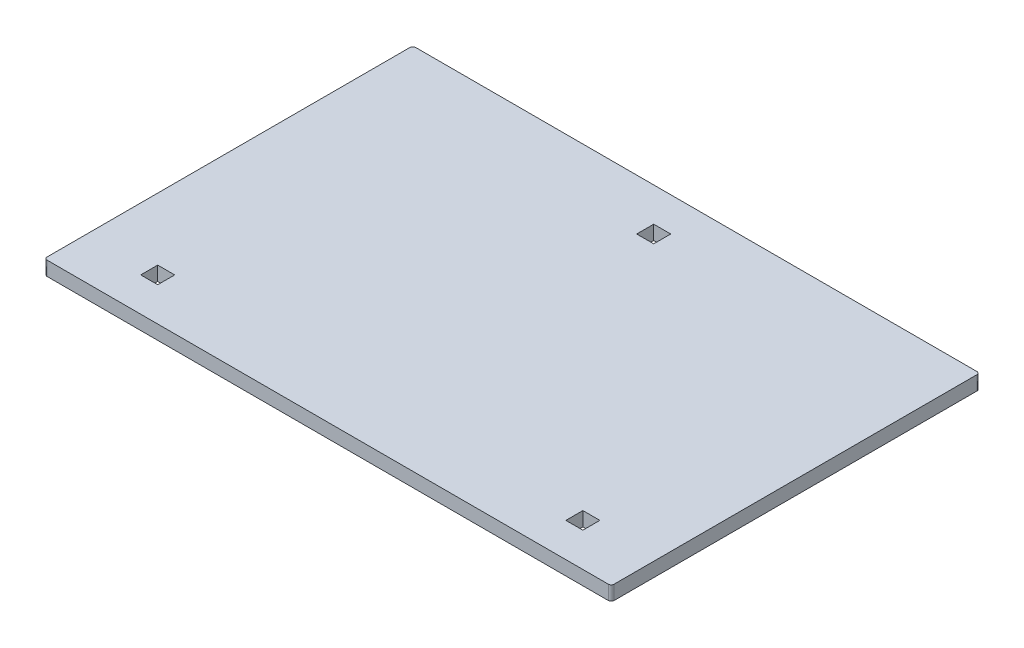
ISO-10303-21;
HEADER;
FILE_DESCRIPTION(('STEP AP214'),'2;1');
FILE_NAME('part.step','',(''),(''),'','','');
FILE_SCHEMA(('AUTOMOTIVE_DESIGN { 1 0 10303 214 1 1 1 1 }'));
ENDSEC;
DATA;
#1=APPLICATION_CONTEXT('core data for automotive mechanical design processes');
#2=APPLICATION_PROTOCOL_DEFINITION('international standard','automotive_design',2000,#1);
#3=PRODUCT_CONTEXT('',#1,'mechanical');
#4=PRODUCT('Part','Part','',(#3));
#5=PRODUCT_RELATED_PRODUCT_CATEGORY('part','',(#4));
#6=PRODUCT_DEFINITION_FORMATION('','',#4);
#7=PRODUCT_DEFINITION_CONTEXT('part definition',#1,'design');
#8=PRODUCT_DEFINITION('design','',#6,#7);
#9=PRODUCT_DEFINITION_SHAPE('','',#8);
#10=(LENGTH_UNIT() NAMED_UNIT(*) SI_UNIT(.MILLI.,.METRE.));
#11=(NAMED_UNIT(*) PLANE_ANGLE_UNIT() SI_UNIT($,.RADIAN.));
#12=(NAMED_UNIT(*) SI_UNIT($,.STERADIAN.) SOLID_ANGLE_UNIT());
#13=UNCERTAINTY_MEASURE_WITH_UNIT(LENGTH_MEASURE(1.E-05),#10,'distance_accuracy_value','');
#14=(GEOMETRIC_REPRESENTATION_CONTEXT(3) GLOBAL_UNCERTAINTY_ASSIGNED_CONTEXT((#13)) GLOBAL_UNIT_ASSIGNED_CONTEXT((#10,
#11,#12)) REPRESENTATION_CONTEXT('',''));
#15=CARTESIAN_POINT('',(0.,0.,0.));
#16=DIRECTION('',(0.,0.,1.));
#17=DIRECTION('',(1.,0.,0.));
#18=AXIS2_PLACEMENT_3D('',#15,#16,#17);
#19=CARTESIAN_POINT('',(0.,5.,0.));
#20=DIRECTION('',(0.,1.,0.));
#21=DIRECTION('',(0.,0.,1.));
#22=AXIS2_PLACEMENT_3D('',#19,#20,#21);
#23=PLANE('',#22);
#24=DIRECTION('',(1.,0.,0.));
#25=VECTOR('',#24,1.);
#26=CARTESIAN_POINT('',(22.,5.,118.));
#27=LINE('',#26,#25);
#28=CARTESIAN_POINT('',(22.,5.,118.));
#29=VERTEX_POINT('',#28);
#30=CARTESIAN_POINT('',(28.,5.,118.));
#31=VERTEX_POINT('',#30);
#32=EDGE_CURVE('E214',#29,#31,#27,.T.);
#33=ORIENTED_EDGE('',*,*,#32,.F.);
#34=DIRECTION('',(0.,0.,1.));
#35=VECTOR('',#34,1.);
#36=CARTESIAN_POINT('',(22.,5.,112.));
#37=LINE('',#36,#35);
#38=CARTESIAN_POINT('',(22.,5.,112.));
#39=VERTEX_POINT('',#38);
#40=EDGE_CURVE('E212',#39,#29,#37,.T.);
#41=ORIENTED_EDGE('',*,*,#40,.F.);
#42=DIRECTION('',(-1.,0.,0.));
#43=VECTOR('',#42,1.);
#44=CARTESIAN_POINT('',(22.,5.,112.));
#45=LINE('',#44,#43);
#46=CARTESIAN_POINT('',(28.,5.,112.));
#47=VERTEX_POINT('',#46);
#48=EDGE_CURVE('E220',#47,#39,#45,.T.);
#49=ORIENTED_EDGE('',*,*,#48,.F.);
#50=DIRECTION('',(0.,0.,-1.));
#51=VECTOR('',#50,1.);
#52=CARTESIAN_POINT('',(28.,5.,112.));
#53=LINE('',#52,#51);
#54=EDGE_CURVE('E217',#31,#47,#53,.T.);
#55=ORIENTED_EDGE('',*,*,#54,.F.);
#56=EDGE_LOOP('',(#33,#41,#49,#55));
#57=FACE_BOUND('',#56,.T.);
#58=DIRECTION('',(-1.,0.,0.));
#59=VECTOR('',#58,1.);
#60=CARTESIAN_POINT('',(0.,5.,0.));
#61=LINE('',#60,#59);
#62=CARTESIAN_POINT('',(199.,5.,0.));
#63=VERTEX_POINT('',#62);
#64=CARTESIAN_POINT('',(1.,5.,0.));
#65=VERTEX_POINT('',#64);
#66=EDGE_CURVE('E281',#63,#65,#61,.T.);
#67=ORIENTED_EDGE('',*,*,#66,.T.);
#68=CARTESIAN_POINT('',(1.,5.,1.));
#69=DIRECTION('',(0.,1.,0.));
#70=DIRECTION('',(0.,0.,1.));
#71=AXIS2_PLACEMENT_3D('',#68,#69,#70);
#72=CIRCLE('',#71,1.);
#73=CARTESIAN_POINT('',(0.,5.,1.));
#74=VERTEX_POINT('',#73);
#75=EDGE_CURVE('E316',#65,#74,#72,.T.);
#76=ORIENTED_EDGE('',*,*,#75,.T.);
#77=DIRECTION('',(0.,0.,1.));
#78=VECTOR('',#77,1.);
#79=CARTESIAN_POINT('',(0.,5.,0.));
#80=LINE('',#79,#78);
#81=CARTESIAN_POINT('',(0.,5.,129.));
#82=VERTEX_POINT('',#81);
#83=EDGE_CURVE('E273',#74,#82,#80,.T.);
#84=ORIENTED_EDGE('',*,*,#83,.T.);
#85=CARTESIAN_POINT('',(1.00000000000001,5.,129.));
#86=DIRECTION('',(0.,1.,0.));
#87=DIRECTION('',(0.,0.,1.));
#88=AXIS2_PLACEMENT_3D('',#85,#86,#87);
#89=CIRCLE('',#88,1.);
#90=CARTESIAN_POINT('',(1.00000000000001,5.,130.));
#91=VERTEX_POINT('',#90);
#92=EDGE_CURVE('E314',#82,#91,#89,.T.);
#93=ORIENTED_EDGE('',*,*,#92,.T.);
#94=DIRECTION('',(1.,0.,0.));
#95=VECTOR('',#94,1.);
#96=CARTESIAN_POINT('',(0.,5.,130.));
#97=LINE('',#96,#95);
#98=CARTESIAN_POINT('',(199.,5.,130.));
#99=VERTEX_POINT('',#98);
#100=EDGE_CURVE('E276',#91,#99,#97,.T.);
#101=ORIENTED_EDGE('',*,*,#100,.T.);
#102=CARTESIAN_POINT('',(199.,5.,129.));
#103=DIRECTION('',(0.,1.,0.));
#104=DIRECTION('',(0.,0.,1.));
#105=AXIS2_PLACEMENT_3D('',#102,#103,#104);
#106=CIRCLE('',#105,1.);
#107=CARTESIAN_POINT('',(200.,5.,129.));
#108=VERTEX_POINT('',#107);
#109=EDGE_CURVE('E53',#99,#108,#106,.T.);
#110=ORIENTED_EDGE('',*,*,#109,.T.);
#111=DIRECTION('',(0.,0.,-1.));
#112=VECTOR('',#111,1.);
#113=CARTESIAN_POINT('',(200.,5.,0.));
#114=LINE('',#113,#112);
#115=CARTESIAN_POINT('',(200.,5.,1.));
#116=VERTEX_POINT('',#115);
#117=EDGE_CURVE('E279',#108,#116,#114,.T.);
#118=ORIENTED_EDGE('',*,*,#117,.T.);
#119=CARTESIAN_POINT('',(199.,5.,1.));
#120=DIRECTION('',(0.,1.,0.));
#121=DIRECTION('',(0.,0.,1.));
#122=AXIS2_PLACEMENT_3D('',#119,#120,#121);
#123=CIRCLE('',#122,1.);
#124=EDGE_CURVE('E312',#116,#63,#123,.T.);
#125=ORIENTED_EDGE('',*,*,#124,.T.);
#126=EDGE_LOOP('',(#67,#76,#84,#93,#101,#110,#118,#125));
#127=FACE_BOUND('',#126,.T.);
#128=DIRECTION('',(1.,0.,0.));
#129=VECTOR('',#128,1.);
#130=CARTESIAN_POINT('',(100.,5.,18.));
#131=LINE('',#130,#129);
#132=CARTESIAN_POINT('',(97.,5.,18.));
#133=VERTEX_POINT('',#132);
#134=CARTESIAN_POINT('',(103.,5.,18.));
#135=VERTEX_POINT('',#134);
#136=EDGE_CURVE('E248',#133,#135,#131,.T.);
#137=ORIENTED_EDGE('',*,*,#136,.F.);
#138=DIRECTION('',(0.,0.,1.));
#139=VECTOR('',#138,1.);
#140=CARTESIAN_POINT('',(97.,5.,12.));
#141=LINE('',#140,#139);
#142=CARTESIAN_POINT('',(97.,5.,12.));
#143=VERTEX_POINT('',#142);
#144=EDGE_CURVE('E245',#143,#133,#141,.T.);
#145=ORIENTED_EDGE('',*,*,#144,.F.);
#146=DIRECTION('',(-1.,0.,0.));
#147=VECTOR('',#146,1.);
#148=CARTESIAN_POINT('',(100.,5.,12.));
#149=LINE('',#148,#147);
#150=CARTESIAN_POINT('',(103.,5.,12.));
#151=VERTEX_POINT('',#150);
#152=EDGE_CURVE('E243',#151,#143,#149,.T.);
#153=ORIENTED_EDGE('',*,*,#152,.F.);
#154=DIRECTION('',(0.,0.,-1.));
#155=VECTOR('',#154,1.);
#156=CARTESIAN_POINT('',(103.,5.,12.));
#157=LINE('',#156,#155);
#158=EDGE_CURVE('E250',#135,#151,#157,.T.);
#159=ORIENTED_EDGE('',*,*,#158,.F.);
#160=EDGE_LOOP('',(#137,#145,#153,#159));
#161=FACE_BOUND('',#160,.T.);
#162=DIRECTION('',(1.,0.,0.));
#163=VECTOR('',#162,1.);
#164=CARTESIAN_POINT('',(172.,5.,118.));
#165=LINE('',#164,#163);
#166=CARTESIAN_POINT('',(172.,5.,118.));
#167=VERTEX_POINT('',#166);
#168=CARTESIAN_POINT('',(178.,5.,118.));
#169=VERTEX_POINT('',#168);
#170=EDGE_CURVE('E181',#167,#169,#165,.T.);
#171=ORIENTED_EDGE('',*,*,#170,.F.);
#172=DIRECTION('',(0.,0.,1.));
#173=VECTOR('',#172,1.);
#174=CARTESIAN_POINT('',(172.,5.,112.));
#175=LINE('',#174,#173);
#176=CARTESIAN_POINT('',(172.,5.,112.));
#177=VERTEX_POINT('',#176);
#178=EDGE_CURVE('E171',#177,#167,#175,.T.);
#179=ORIENTED_EDGE('',*,*,#178,.F.);
#180=DIRECTION('',(-1.,0.,0.));
#181=VECTOR('',#180,1.);
#182=CARTESIAN_POINT('',(172.,5.,112.));
#183=LINE('',#182,#181);
#184=CARTESIAN_POINT('',(178.,5.,112.));
#185=VERTEX_POINT('',#184);
#186=EDGE_CURVE('E196',#185,#177,#183,.T.);
#187=ORIENTED_EDGE('',*,*,#186,.F.);
#188=DIRECTION('',(0.,0.,-1.));
#189=VECTOR('',#188,1.);
#190=CARTESIAN_POINT('',(178.,5.,112.));
#191=LINE('',#190,#189);
#192=EDGE_CURVE('E194',#169,#185,#191,.T.);
#193=ORIENTED_EDGE('',*,*,#192,.F.);
#194=EDGE_LOOP('',(#171,#179,#187,#193));
#195=FACE_BOUND('',#194,.T.);
#196=ADVANCED_FACE('F33',(#57,#127,#161,#195),#23,.T.);
#197=CARTESIAN_POINT('',(0.,0.,0.));
#198=DIRECTION('',(0.,1.,0.));
#199=DIRECTION('',(0.,0.,1.));
#200=AXIS2_PLACEMENT_3D('',#197,#198,#199);
#201=PLANE('',#200);
#202=DIRECTION('',(0.,0.,1.));
#203=VECTOR('',#202,1.);
#204=CARTESIAN_POINT('',(22.,0.,112.));
#205=LINE('',#204,#203);
#206=CARTESIAN_POINT('',(22.,0.,112.));
#207=VERTEX_POINT('',#206);
#208=CARTESIAN_POINT('',(22.,0.,118.));
#209=VERTEX_POINT('',#208);
#210=EDGE_CURVE('E189',#207,#209,#205,.T.);
#211=ORIENTED_EDGE('',*,*,#210,.T.);
#212=DIRECTION('',(1.,0.,0.));
#213=VECTOR('',#212,1.);
#214=CARTESIAN_POINT('',(22.,0.,118.));
#215=LINE('',#214,#213);
#216=CARTESIAN_POINT('',(28.,0.,118.));
#217=VERTEX_POINT('',#216);
#218=EDGE_CURVE('E225',#209,#217,#215,.T.);
#219=ORIENTED_EDGE('',*,*,#218,.T.);
#220=DIRECTION('',(0.,0.,-1.));
#221=VECTOR('',#220,1.);
#222=CARTESIAN_POINT('',(28.,0.,112.));
#223=LINE('',#222,#221);
#224=CARTESIAN_POINT('',(28.,0.,112.));
#225=VERTEX_POINT('',#224);
#226=EDGE_CURVE('E228',#217,#225,#223,.T.);
#227=ORIENTED_EDGE('',*,*,#226,.T.);
#228=DIRECTION('',(-1.,0.,0.));
#229=VECTOR('',#228,1.);
#230=CARTESIAN_POINT('',(22.,0.,112.));
#231=LINE('',#230,#229);
#232=EDGE_CURVE('E215',#225,#207,#231,.T.);
#233=ORIENTED_EDGE('',*,*,#232,.T.);
#234=EDGE_LOOP('',(#211,#219,#227,#233));
#235=FACE_BOUND('',#234,.T.);
#236=DIRECTION('',(0.,0.,1.));
#237=VECTOR('',#236,1.);
#238=CARTESIAN_POINT('',(0.,0.,0.));
#239=LINE('',#238,#237);
#240=CARTESIAN_POINT('',(0.,0.,1.));
#241=VERTEX_POINT('',#240);
#242=CARTESIAN_POINT('',(0.,0.,129.));
#243=VERTEX_POINT('',#242);
#244=EDGE_CURVE('E272',#241,#243,#239,.T.);
#245=ORIENTED_EDGE('',*,*,#244,.F.);
#246=CARTESIAN_POINT('',(1.,0.,1.));
#247=DIRECTION('',(0.,1.,0.));
#248=DIRECTION('',(0.,0.,1.));
#249=AXIS2_PLACEMENT_3D('',#246,#247,#248);
#250=CIRCLE('',#249,1.);
#251=CARTESIAN_POINT('',(1.,0.,0.));
#252=VERTEX_POINT('',#251);
#253=EDGE_CURVE('E304',#241,#252,#250,.F.);
#254=ORIENTED_EDGE('',*,*,#253,.T.);
#255=DIRECTION('',(-1.,0.,0.));
#256=VECTOR('',#255,1.);
#257=CARTESIAN_POINT('',(0.,0.,0.));
#258=LINE('',#257,#256);
#259=CARTESIAN_POINT('',(199.,0.,0.));
#260=VERTEX_POINT('',#259);
#261=EDGE_CURVE('E277',#260,#252,#258,.T.);
#262=ORIENTED_EDGE('',*,*,#261,.F.);
#263=CARTESIAN_POINT('',(199.,0.,1.));
#264=DIRECTION('',(0.,1.,0.));
#265=DIRECTION('',(0.,0.,1.));
#266=AXIS2_PLACEMENT_3D('',#263,#264,#265);
#267=CIRCLE('',#266,1.);
#268=CARTESIAN_POINT('',(200.,0.,1.));
#269=VERTEX_POINT('',#268);
#270=EDGE_CURVE('E300',#260,#269,#267,.F.);
#271=ORIENTED_EDGE('',*,*,#270,.T.);
#272=DIRECTION('',(0.,0.,-1.));
#273=VECTOR('',#272,1.);
#274=CARTESIAN_POINT('',(200.,0.,0.));
#275=LINE('',#274,#273);
#276=CARTESIAN_POINT('',(200.,0.,129.));
#277=VERTEX_POINT('',#276);
#278=EDGE_CURVE('E290',#277,#269,#275,.T.);
#279=ORIENTED_EDGE('',*,*,#278,.F.);
#280=CARTESIAN_POINT('',(199.,0.,129.));
#281=DIRECTION('',(0.,1.,0.));
#282=DIRECTION('',(0.,0.,1.));
#283=AXIS2_PLACEMENT_3D('',#280,#281,#282);
#284=CIRCLE('',#283,1.);
#285=CARTESIAN_POINT('',(199.,0.,130.));
#286=VERTEX_POINT('',#285);
#287=EDGE_CURVE('E298',#277,#286,#284,.F.);
#288=ORIENTED_EDGE('',*,*,#287,.T.);
#289=DIRECTION('',(1.,0.,0.));
#290=VECTOR('',#289,1.);
#291=CARTESIAN_POINT('',(102.55,0.,130.));
#292=LINE('',#291,#290);
#293=CARTESIAN_POINT('',(1.00000000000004,0.,130.));
#294=VERTEX_POINT('',#293);
#295=EDGE_CURVE('E287',#294,#286,#292,.T.);
#296=ORIENTED_EDGE('',*,*,#295,.F.);
#297=CARTESIAN_POINT('',(1.00000000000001,0.,129.));
#298=DIRECTION('',(0.,1.,0.));
#299=DIRECTION('',(0.,0.,1.));
#300=AXIS2_PLACEMENT_3D('',#297,#298,#299);
#301=CIRCLE('',#300,1.);
#302=EDGE_CURVE('E302',#294,#243,#301,.F.);
#303=ORIENTED_EDGE('',*,*,#302,.T.);
#304=EDGE_LOOP('',(#245,#254,#262,#271,#279,#288,#296,#303));
#305=FACE_BOUND('',#304,.T.);
#306=DIRECTION('',(0.,0.,1.));
#307=VECTOR('',#306,1.);
#308=CARTESIAN_POINT('',(97.,0.,12.));
#309=LINE('',#308,#307);
#310=CARTESIAN_POINT('',(97.,0.,12.));
#311=VERTEX_POINT('',#310);
#312=CARTESIAN_POINT('',(97.,0.,18.));
#313=VERTEX_POINT('',#312);
#314=EDGE_CURVE('E242',#311,#313,#309,.T.);
#315=ORIENTED_EDGE('',*,*,#314,.T.);
#316=DIRECTION('',(1.,0.,0.));
#317=VECTOR('',#316,1.);
#318=CARTESIAN_POINT('',(100.,0.,18.));
#319=LINE('',#318,#317);
#320=CARTESIAN_POINT('',(103.,0.,18.));
#321=VERTEX_POINT('',#320);
#322=EDGE_CURVE('E256',#313,#321,#319,.T.);
#323=ORIENTED_EDGE('',*,*,#322,.T.);
#324=DIRECTION('',(0.,0.,-1.));
#325=VECTOR('',#324,1.);
#326=CARTESIAN_POINT('',(103.,0.,12.));
#327=LINE('',#326,#325);
#328=CARTESIAN_POINT('',(103.,0.,12.));
#329=VERTEX_POINT('',#328);
#330=EDGE_CURVE('E259',#321,#329,#327,.T.);
#331=ORIENTED_EDGE('',*,*,#330,.T.);
#332=DIRECTION('',(-1.,0.,0.));
#333=VECTOR('',#332,1.);
#334=CARTESIAN_POINT('',(100.,0.,12.));
#335=LINE('',#334,#333);
#336=EDGE_CURVE('E246',#329,#311,#335,.T.);
#337=ORIENTED_EDGE('',*,*,#336,.T.);
#338=EDGE_LOOP('',(#315,#323,#331,#337));
#339=FACE_BOUND('',#338,.T.);
#340=DIRECTION('',(0.,0.,1.));
#341=VECTOR('',#340,1.);
#342=CARTESIAN_POINT('',(172.,0.,112.));
#343=LINE('',#342,#341);
#344=CARTESIAN_POINT('',(172.,0.,112.));
#345=VERTEX_POINT('',#344);
#346=CARTESIAN_POINT('',(172.,0.,118.));
#347=VERTEX_POINT('',#346);
#348=EDGE_CURVE('E200',#345,#347,#343,.T.);
#349=ORIENTED_EDGE('',*,*,#348,.T.);
#350=DIRECTION('',(1.,0.,0.));
#351=VECTOR('',#350,1.);
#352=CARTESIAN_POINT('',(172.,0.,118.));
#353=LINE('',#352,#351);
#354=CARTESIAN_POINT('',(178.,0.,118.));
#355=VERTEX_POINT('',#354);
#356=EDGE_CURVE('E188',#347,#355,#353,.T.);
#357=ORIENTED_EDGE('',*,*,#356,.T.);
#358=DIRECTION('',(0.,0.,-1.));
#359=VECTOR('',#358,1.);
#360=CARTESIAN_POINT('',(178.,0.,112.));
#361=LINE('',#360,#359);
#362=CARTESIAN_POINT('',(178.,0.,112.));
#363=VERTEX_POINT('',#362);
#364=EDGE_CURVE('E203',#355,#363,#361,.T.);
#365=ORIENTED_EDGE('',*,*,#364,.T.);
#366=DIRECTION('',(-1.,0.,0.));
#367=VECTOR('',#366,1.);
#368=CARTESIAN_POINT('',(172.,0.,112.));
#369=LINE('',#368,#367);
#370=EDGE_CURVE('E182',#363,#345,#369,.T.);
#371=ORIENTED_EDGE('',*,*,#370,.T.);
#372=EDGE_LOOP('',(#349,#357,#365,#371));
#373=FACE_BOUND('',#372,.T.);
#374=ADVANCED_FACE('F329',(#235,#305,#339,#373),#201,.F.);
#375=CARTESIAN_POINT('',(0.,5.,0.));
#376=DIRECTION('',(1.,0.,0.));
#377=DIRECTION('',(0.,0.,-1.));
#378=AXIS2_PLACEMENT_3D('',#375,#376,#377);
#379=PLANE('',#378);
#380=ORIENTED_EDGE('',*,*,#83,.F.);
#381=DIRECTION('',(0.,-1.,0.));
#382=VECTOR('',#381,1.);
#383=CARTESIAN_POINT('',(0.,5.,1.));
#384=LINE('',#383,#382);
#385=EDGE_CURVE('E295',#74,#241,#384,.T.);
#386=ORIENTED_EDGE('',*,*,#385,.T.);
#387=ORIENTED_EDGE('',*,*,#244,.T.);
#388=DIRECTION('',(0.,-1.,0.));
#389=VECTOR('',#388,1.);
#390=CARTESIAN_POINT('',(0.,5.,129.));
#391=LINE('',#390,#389);
#392=EDGE_CURVE('E284',#243,#82,#391,.F.);
#393=ORIENTED_EDGE('',*,*,#392,.T.);
#394=EDGE_LOOP('',(#380,#386,#387,#393));
#395=FACE_BOUND('',#394,.T.);
#396=ADVANCED_FACE('F348',(#395),#379,.F.);
#397=CARTESIAN_POINT('',(102.55,5.,130.));
#398=DIRECTION('',(0.,0.,-1.));
#399=DIRECTION('',(-1.,0.,0.));
#400=AXIS2_PLACEMENT_3D('',#397,#398,#399);
#401=PLANE('',#400);
#402=ORIENTED_EDGE('',*,*,#100,.F.);
#403=DIRECTION('',(0.,-1.,0.));
#404=VECTOR('',#403,1.);
#405=CARTESIAN_POINT('',(1.00000000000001,5.,130.));
#406=LINE('',#405,#404);
#407=EDGE_CURVE('E320',#91,#294,#406,.T.);
#408=ORIENTED_EDGE('',*,*,#407,.T.);
#409=ORIENTED_EDGE('',*,*,#295,.T.);
#410=DIRECTION('',(0.,-1.,0.));
#411=VECTOR('',#410,1.);
#412=CARTESIAN_POINT('',(199.,5.,130.));
#413=LINE('',#412,#411);
#414=EDGE_CURVE('E318',#286,#99,#413,.F.);
#415=ORIENTED_EDGE('',*,*,#414,.T.);
#416=EDGE_LOOP('',(#402,#408,#409,#415));
#417=FACE_BOUND('',#416,.T.);
#418=ADVANCED_FACE('F356',(#417),#401,.F.);
#419=CARTESIAN_POINT('',(200.,5.,0.));
#420=DIRECTION('',(-1.,0.,0.));
#421=DIRECTION('',(0.,0.,1.));
#422=AXIS2_PLACEMENT_3D('',#419,#420,#421);
#423=PLANE('',#422);
#424=ORIENTED_EDGE('',*,*,#278,.T.);
#425=DIRECTION('',(0.,-1.,0.));
#426=VECTOR('',#425,1.);
#427=CARTESIAN_POINT('',(200.,5.,1.));
#428=LINE('',#427,#426);
#429=EDGE_CURVE('E11',#269,#116,#428,.F.);
#430=ORIENTED_EDGE('',*,*,#429,.T.);
#431=ORIENTED_EDGE('',*,*,#117,.F.);
#432=DIRECTION('',(0.,-1.,0.));
#433=VECTOR('',#432,1.);
#434=CARTESIAN_POINT('',(200.,5.,129.));
#435=LINE('',#434,#433);
#436=EDGE_CURVE('E41',#108,#277,#435,.T.);
#437=ORIENTED_EDGE('',*,*,#436,.T.);
#438=EDGE_LOOP('',(#424,#430,#431,#437));
#439=FACE_BOUND('',#438,.T.);
#440=ADVANCED_FACE('F325',(#439),#423,.F.);
#441=CARTESIAN_POINT('',(0.,5.,0.));
#442=DIRECTION('',(0.,0.,1.));
#443=DIRECTION('',(1.,0.,0.));
#444=AXIS2_PLACEMENT_3D('',#441,#442,#443);
#445=PLANE('',#444);
#446=ORIENTED_EDGE('',*,*,#261,.T.);
#447=DIRECTION('',(0.,-1.,0.));
#448=VECTOR('',#447,1.);
#449=CARTESIAN_POINT('',(1.,5.,0.));
#450=LINE('',#449,#448);
#451=EDGE_CURVE('E309',#252,#65,#450,.F.);
#452=ORIENTED_EDGE('',*,*,#451,.T.);
#453=ORIENTED_EDGE('',*,*,#66,.F.);
#454=DIRECTION('',(0.,-1.,0.));
#455=VECTOR('',#454,1.);
#456=CARTESIAN_POINT('',(199.,5.,0.));
#457=LINE('',#456,#455);
#458=EDGE_CURVE('E306',#63,#260,#457,.T.);
#459=ORIENTED_EDGE('',*,*,#458,.T.);
#460=EDGE_LOOP('',(#446,#452,#453,#459));
#461=FACE_BOUND('',#460,.T.);
#462=ADVANCED_FACE('F339',(#461),#445,.F.);
#463=CARTESIAN_POINT('',(97.,5.,12.));
#464=DIRECTION('',(1.,0.,0.));
#465=DIRECTION('',(0.,0.,-1.));
#466=AXIS2_PLACEMENT_3D('',#463,#464,#465);
#467=PLANE('',#466);
#468=ORIENTED_EDGE('',*,*,#314,.F.);
#469=DIRECTION('',(0.,-1.,0.));
#470=VECTOR('',#469,1.);
#471=CARTESIAN_POINT('',(97.,5.,12.));
#472=LINE('',#471,#470);
#473=EDGE_CURVE('E270',#143,#311,#472,.T.);
#474=ORIENTED_EDGE('',*,*,#473,.F.);
#475=ORIENTED_EDGE('',*,*,#144,.T.);
#476=DIRECTION('',(0.,-1.,0.));
#477=VECTOR('',#476,1.);
#478=CARTESIAN_POINT('',(97.,5.,18.));
#479=LINE('',#478,#477);
#480=EDGE_CURVE('E267',#133,#313,#479,.T.);
#481=ORIENTED_EDGE('',*,*,#480,.T.);
#482=EDGE_LOOP('',(#468,#474,#475,#481));
#483=FACE_BOUND('',#482,.T.);
#484=ADVANCED_FACE('F372',(#483),#467,.T.);
#485=CARTESIAN_POINT('',(100.,5.,18.));
#486=DIRECTION('',(0.,0.,-1.));
#487=DIRECTION('',(-1.,0.,0.));
#488=AXIS2_PLACEMENT_3D('',#485,#486,#487);
#489=PLANE('',#488);
#490=ORIENTED_EDGE('',*,*,#322,.F.);
#491=ORIENTED_EDGE('',*,*,#480,.F.);
#492=ORIENTED_EDGE('',*,*,#136,.T.);
#493=DIRECTION('',(0.,-1.,0.));
#494=VECTOR('',#493,1.);
#495=CARTESIAN_POINT('',(103.,5.,18.));
#496=LINE('',#495,#494);
#497=EDGE_CURVE('E265',#135,#321,#496,.T.);
#498=ORIENTED_EDGE('',*,*,#497,.T.);
#499=EDGE_LOOP('',(#490,#491,#492,#498));
#500=FACE_BOUND('',#499,.T.);
#501=ADVANCED_FACE('F496',(#500),#489,.T.);
#502=CARTESIAN_POINT('',(103.,5.,12.));
#503=DIRECTION('',(-1.,0.,0.));
#504=DIRECTION('',(0.,0.,1.));
#505=AXIS2_PLACEMENT_3D('',#502,#503,#504);
#506=PLANE('',#505);
#507=ORIENTED_EDGE('',*,*,#330,.F.);
#508=ORIENTED_EDGE('',*,*,#497,.F.);
#509=ORIENTED_EDGE('',*,*,#158,.T.);
#510=DIRECTION('',(0.,-1.,0.));
#511=VECTOR('',#510,1.);
#512=CARTESIAN_POINT('',(103.,5.,12.));
#513=LINE('',#512,#511);
#514=EDGE_CURVE('E253',#151,#329,#513,.T.);
#515=ORIENTED_EDGE('',*,*,#514,.T.);
#516=EDGE_LOOP('',(#507,#508,#509,#515));
#517=FACE_BOUND('',#516,.T.);
#518=ADVANCED_FACE('F484',(#517),#506,.T.);
#519=CARTESIAN_POINT('',(100.,5.,12.));
#520=DIRECTION('',(0.,0.,1.));
#521=DIRECTION('',(1.,0.,0.));
#522=AXIS2_PLACEMENT_3D('',#519,#520,#521);
#523=PLANE('',#522);
#524=ORIENTED_EDGE('',*,*,#336,.F.);
#525=ORIENTED_EDGE('',*,*,#514,.F.);
#526=ORIENTED_EDGE('',*,*,#152,.T.);
#527=ORIENTED_EDGE('',*,*,#473,.T.);
#528=EDGE_LOOP('',(#524,#525,#526,#527));
#529=FACE_BOUND('',#528,.T.);
#530=ADVANCED_FACE('F475',(#529),#523,.T.);
#531=CARTESIAN_POINT('',(22.,5.,112.));
#532=DIRECTION('',(1.,0.,0.));
#533=DIRECTION('',(0.,0.,-1.));
#534=AXIS2_PLACEMENT_3D('',#531,#532,#533);
#535=PLANE('',#534);
#536=ORIENTED_EDGE('',*,*,#210,.F.);
#537=DIRECTION('',(0.,-1.,0.));
#538=VECTOR('',#537,1.);
#539=CARTESIAN_POINT('',(22.,5.,112.));
#540=LINE('',#539,#538);
#541=EDGE_CURVE('E222',#39,#207,#540,.T.);
#542=ORIENTED_EDGE('',*,*,#541,.F.);
#543=ORIENTED_EDGE('',*,*,#40,.T.);
#544=DIRECTION('',(0.,-1.,0.));
#545=VECTOR('',#544,1.);
#546=CARTESIAN_POINT('',(22.,5.,118.));
#547=LINE('',#546,#545);
#548=EDGE_CURVE('E239',#29,#209,#547,.T.);
#549=ORIENTED_EDGE('',*,*,#548,.T.);
#550=EDGE_LOOP('',(#536,#542,#543,#549));
#551=FACE_BOUND('',#550,.T.);
#552=ADVANCED_FACE('F466',(#551),#535,.T.);
#553=CARTESIAN_POINT('',(22.,5.,118.));
#554=DIRECTION('',(0.,0.,-1.));
#555=DIRECTION('',(-1.,0.,0.));
#556=AXIS2_PLACEMENT_3D('',#553,#554,#555);
#557=PLANE('',#556);
#558=ORIENTED_EDGE('',*,*,#218,.F.);
#559=ORIENTED_EDGE('',*,*,#548,.F.);
#560=ORIENTED_EDGE('',*,*,#32,.T.);
#561=DIRECTION('',(0.,-1.,0.));
#562=VECTOR('',#561,1.);
#563=CARTESIAN_POINT('',(28.,5.,118.));
#564=LINE('',#563,#562);
#565=EDGE_CURVE('E237',#31,#217,#564,.T.);
#566=ORIENTED_EDGE('',*,*,#565,.T.);
#567=EDGE_LOOP('',(#558,#559,#560,#566));
#568=FACE_BOUND('',#567,.T.);
#569=ADVANCED_FACE('F457',(#568),#557,.T.);
#570=CARTESIAN_POINT('',(28.,5.,112.));
#571=DIRECTION('',(-1.,0.,0.));
#572=DIRECTION('',(0.,0.,1.));
#573=AXIS2_PLACEMENT_3D('',#570,#571,#572);
#574=PLANE('',#573);
#575=ORIENTED_EDGE('',*,*,#226,.F.);
#576=ORIENTED_EDGE('',*,*,#565,.F.);
#577=ORIENTED_EDGE('',*,*,#54,.T.);
#578=DIRECTION('',(0.,-1.,0.));
#579=VECTOR('',#578,1.);
#580=CARTESIAN_POINT('',(28.,5.,112.));
#581=LINE('',#580,#579);
#582=EDGE_CURVE('E235',#47,#225,#581,.T.);
#583=ORIENTED_EDGE('',*,*,#582,.T.);
#584=EDGE_LOOP('',(#575,#576,#577,#583));
#585=FACE_BOUND('',#584,.T.);
#586=ADVANCED_FACE('F448',(#585),#574,.T.);
#587=CARTESIAN_POINT('',(22.,5.,112.));
#588=DIRECTION('',(0.,0.,1.));
#589=DIRECTION('',(1.,0.,0.));
#590=AXIS2_PLACEMENT_3D('',#587,#588,#589);
#591=PLANE('',#590);
#592=ORIENTED_EDGE('',*,*,#232,.F.);
#593=ORIENTED_EDGE('',*,*,#582,.F.);
#594=ORIENTED_EDGE('',*,*,#48,.T.);
#595=ORIENTED_EDGE('',*,*,#541,.T.);
#596=EDGE_LOOP('',(#592,#593,#594,#595));
#597=FACE_BOUND('',#596,.T.);
#598=ADVANCED_FACE('F440',(#597),#591,.T.);
#599=CARTESIAN_POINT('',(172.,5.,112.));
#600=DIRECTION('',(1.,0.,0.));
#601=DIRECTION('',(0.,0.,-1.));
#602=AXIS2_PLACEMENT_3D('',#599,#600,#601);
#603=PLANE('',#602);
#604=ORIENTED_EDGE('',*,*,#348,.F.);
#605=DIRECTION('',(0.,-1.,0.));
#606=VECTOR('',#605,1.);
#607=CARTESIAN_POINT('',(172.,5.,112.));
#608=LINE('',#607,#606);
#609=EDGE_CURVE('E177',#177,#345,#608,.T.);
#610=ORIENTED_EDGE('',*,*,#609,.F.);
#611=ORIENTED_EDGE('',*,*,#178,.T.);
#612=DIRECTION('',(0.,-1.,0.));
#613=VECTOR('',#612,1.);
#614=CARTESIAN_POINT('',(172.,5.,118.));
#615=LINE('',#614,#613);
#616=EDGE_CURVE('E174',#167,#347,#615,.T.);
#617=ORIENTED_EDGE('',*,*,#616,.T.);
#618=EDGE_LOOP('',(#604,#610,#611,#617));
#619=FACE_BOUND('',#618,.T.);
#620=ADVANCED_FACE('F173',(#619),#603,.T.);
#621=CARTESIAN_POINT('',(172.,5.,118.));
#622=DIRECTION('',(0.,0.,-1.));
#623=DIRECTION('',(-1.,0.,0.));
#624=AXIS2_PLACEMENT_3D('',#621,#622,#623);
#625=PLANE('',#624);
#626=ORIENTED_EDGE('',*,*,#356,.F.);
#627=ORIENTED_EDGE('',*,*,#616,.F.);
#628=ORIENTED_EDGE('',*,*,#170,.T.);
#629=DIRECTION('',(0.,-1.,0.));
#630=VECTOR('',#629,1.);
#631=CARTESIAN_POINT('',(178.,5.,118.));
#632=LINE('',#631,#630);
#633=EDGE_CURVE('E190',#169,#355,#632,.T.);
#634=ORIENTED_EDGE('',*,*,#633,.T.);
#635=EDGE_LOOP('',(#626,#627,#628,#634));
#636=FACE_BOUND('',#635,.T.);
#637=ADVANCED_FACE('F185',(#636),#625,.T.);
#638=CARTESIAN_POINT('',(178.,5.,112.));
#639=DIRECTION('',(-1.,0.,0.));
#640=DIRECTION('',(0.,0.,1.));
#641=AXIS2_PLACEMENT_3D('',#638,#639,#640);
#642=PLANE('',#641);
#643=ORIENTED_EDGE('',*,*,#364,.F.);
#644=ORIENTED_EDGE('',*,*,#633,.F.);
#645=ORIENTED_EDGE('',*,*,#192,.T.);
#646=DIRECTION('',(0.,-1.,0.));
#647=VECTOR('',#646,1.);
#648=CARTESIAN_POINT('',(178.,5.,112.));
#649=LINE('',#648,#647);
#650=EDGE_CURVE('E209',#185,#363,#649,.T.);
#651=ORIENTED_EDGE('',*,*,#650,.T.);
#652=EDGE_LOOP('',(#643,#644,#645,#651));
#653=FACE_BOUND('',#652,.T.);
#654=ADVANCED_FACE('F416',(#653),#642,.T.);
#655=CARTESIAN_POINT('',(172.,5.,112.));
#656=DIRECTION('',(0.,0.,1.));
#657=DIRECTION('',(1.,0.,0.));
#658=AXIS2_PLACEMENT_3D('',#655,#656,#657);
#659=PLANE('',#658);
#660=ORIENTED_EDGE('',*,*,#370,.F.);
#661=ORIENTED_EDGE('',*,*,#650,.F.);
#662=ORIENTED_EDGE('',*,*,#186,.T.);
#663=ORIENTED_EDGE('',*,*,#609,.T.);
#664=EDGE_LOOP('',(#660,#661,#662,#663));
#665=FACE_BOUND('',#664,.T.);
#666=ADVANCED_FACE('F385',(#665),#659,.T.);
#667=CARTESIAN_POINT('',(1.,5.,1.));
#668=DIRECTION('',(0.,-1.,0.));
#669=DIRECTION('',(0.,0.,-1.));
#670=AXIS2_PLACEMENT_3D('',#667,#668,#669);
#671=CYLINDRICAL_SURFACE('',#670,1.);
#672=ORIENTED_EDGE('',*,*,#75,.F.);
#673=ORIENTED_EDGE('',*,*,#451,.F.);
#674=ORIENTED_EDGE('',*,*,#253,.F.);
#675=ORIENTED_EDGE('',*,*,#385,.F.);
#676=EDGE_LOOP('',(#672,#673,#674,#675));
#677=FACE_BOUND('',#676,.T.);
#678=ADVANCED_FACE('F346',(#677),#671,.T.);
#679=CARTESIAN_POINT('',(1.00000000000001,5.,129.));
#680=DIRECTION('',(0.,-1.,0.));
#681=DIRECTION('',(0.,0.,-1.));
#682=AXIS2_PLACEMENT_3D('',#679,#680,#681);
#683=CYLINDRICAL_SURFACE('',#682,1.);
#684=ORIENTED_EDGE('',*,*,#92,.F.);
#685=ORIENTED_EDGE('',*,*,#392,.F.);
#686=ORIENTED_EDGE('',*,*,#302,.F.);
#687=ORIENTED_EDGE('',*,*,#407,.F.);
#688=EDGE_LOOP('',(#684,#685,#686,#687));
#689=FACE_BOUND('',#688,.T.);
#690=ADVANCED_FACE('F353',(#689),#683,.T.);
#691=CARTESIAN_POINT('',(199.,5.,1.));
#692=DIRECTION('',(0.,-1.,0.));
#693=DIRECTION('',(0.,0.,-1.));
#694=AXIS2_PLACEMENT_3D('',#691,#692,#693);
#695=CYLINDRICAL_SURFACE('',#694,1.);
#696=ORIENTED_EDGE('',*,*,#124,.F.);
#697=ORIENTED_EDGE('',*,*,#429,.F.);
#698=ORIENTED_EDGE('',*,*,#270,.F.);
#699=ORIENTED_EDGE('',*,*,#458,.F.);
#700=EDGE_LOOP('',(#696,#697,#698,#699));
#701=FACE_BOUND('',#700,.T.);
#702=ADVANCED_FACE('F336',(#701),#695,.T.);
#703=CARTESIAN_POINT('',(199.,5.,129.));
#704=DIRECTION('',(0.,-1.,0.));
#705=DIRECTION('',(0.,0.,-1.));
#706=AXIS2_PLACEMENT_3D('',#703,#704,#705);
#707=CYLINDRICAL_SURFACE('',#706,1.);
#708=ORIENTED_EDGE('',*,*,#109,.F.);
#709=ORIENTED_EDGE('',*,*,#414,.F.);
#710=ORIENTED_EDGE('',*,*,#287,.F.);
#711=ORIENTED_EDGE('',*,*,#436,.F.);
#712=EDGE_LOOP('',(#708,#709,#710,#711));
#713=FACE_BOUND('',#712,.T.);
#714=ADVANCED_FACE('F35',(#713),#707,.T.);
#715=CLOSED_SHELL('',(#196,#374,#396,#418,#440,#462,#484,#501,#518,#530,#552,#569,#586,#598,
#620,#637,#654,#666,#678,#690,#702,#714));
#716=MANIFOLD_SOLID_BREP('B2',#715);
#717=ADVANCED_BREP_SHAPE_REPRESENTATION('',(#18,#716),#14);
#718=SHAPE_DEFINITION_REPRESENTATION(#9,#717);
ENDSEC;
END-ISO-10303-21;
